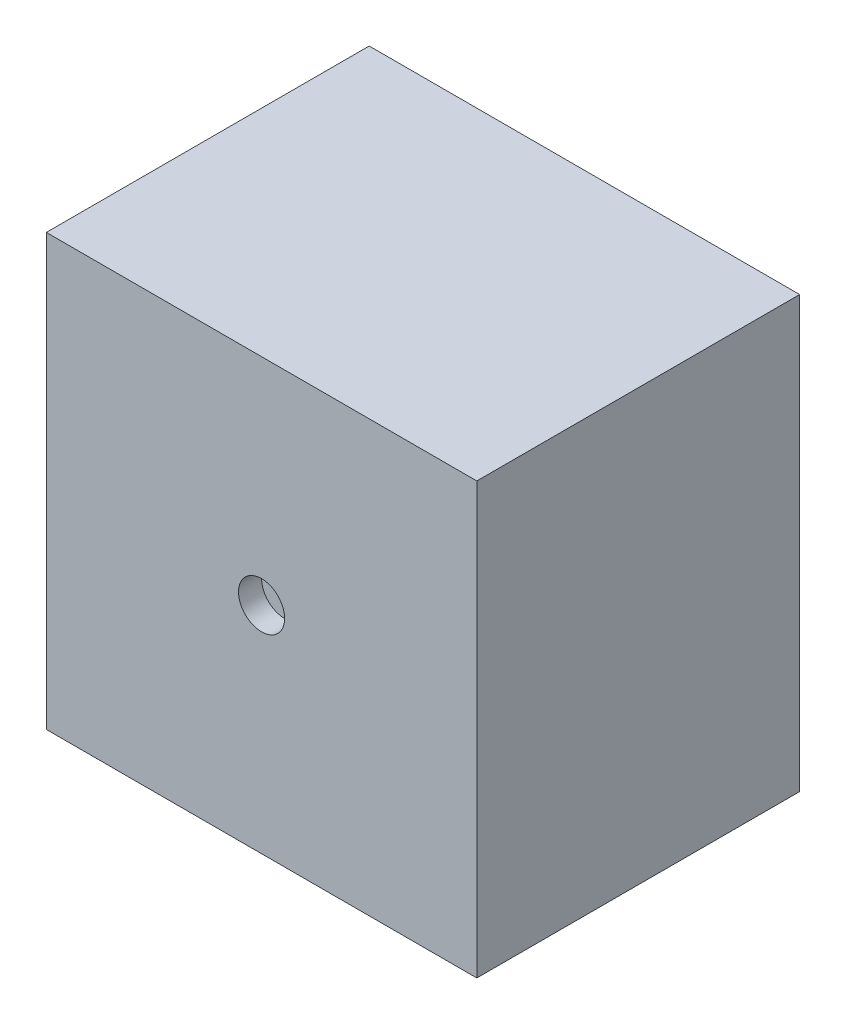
ISO-10303-21;
HEADER;
FILE_DESCRIPTION(('STEP AP214'),'2;1');
FILE_NAME('part.step','',(''),(''),'','','');
FILE_SCHEMA(('AUTOMOTIVE_DESIGN { 1 0 10303 214 1 1 1 1 }'));
ENDSEC;
DATA;
#1=APPLICATION_CONTEXT('core data for automotive mechanical design processes');
#2=APPLICATION_PROTOCOL_DEFINITION('international standard','automotive_design',2000,#1);
#3=PRODUCT_CONTEXT('',#1,'mechanical');
#4=PRODUCT('Part','Part','',(#3));
#5=PRODUCT_RELATED_PRODUCT_CATEGORY('part','',(#4));
#6=PRODUCT_DEFINITION_FORMATION('','',#4);
#7=PRODUCT_DEFINITION_CONTEXT('part definition',#1,'design');
#8=PRODUCT_DEFINITION('design','',#6,#7);
#9=PRODUCT_DEFINITION_SHAPE('','',#8);
#10=(LENGTH_UNIT() NAMED_UNIT(*) SI_UNIT(.MILLI.,.METRE.));
#11=(NAMED_UNIT(*) PLANE_ANGLE_UNIT() SI_UNIT($,.RADIAN.));
#12=(NAMED_UNIT(*) SI_UNIT($,.STERADIAN.) SOLID_ANGLE_UNIT());
#13=UNCERTAINTY_MEASURE_WITH_UNIT(LENGTH_MEASURE(1.E-05),#10,'distance_accuracy_value','');
#14=(GEOMETRIC_REPRESENTATION_CONTEXT(3) GLOBAL_UNCERTAINTY_ASSIGNED_CONTEXT((#13)) GLOBAL_UNIT_ASSIGNED_CONTEXT((#10,
#11,#12)) REPRESENTATION_CONTEXT('',''));
#15=CARTESIAN_POINT('',(0.,0.,0.));
#16=DIRECTION('',(0.,0.,1.));
#17=DIRECTION('',(1.,0.,0.));
#18=AXIS2_PLACEMENT_3D('',#15,#16,#17);
#19=CARTESIAN_POINT('',(0.,0.,42.));
#20=DIRECTION('',(-1.,0.,0.));
#21=DIRECTION('',(0.,-1.,0.));
#22=AXIS2_PLACEMENT_3D('',#19,#20,#21);
#23=PLANE('',#22);
#24=DIRECTION('',(0.,1.,0.));
#25=VECTOR('',#24,1.);
#26=CARTESIAN_POINT('',(0.,0.,0.));
#27=LINE('',#26,#25);
#28=CARTESIAN_POINT('',(0.,0.,0.));
#29=VERTEX_POINT('',#28);
#30=CARTESIAN_POINT('',(0.,56.,0.));
#31=VERTEX_POINT('',#30);
#32=EDGE_CURVE('E110',#29,#31,#27,.T.);
#33=ORIENTED_EDGE('',*,*,#32,.T.);
#34=DIRECTION('',(0.,0.,-1.));
#35=VECTOR('',#34,1.);
#36=CARTESIAN_POINT('',(0.,56.,42.));
#37=LINE('',#36,#35);
#38=CARTESIAN_POINT('',(0.,56.,42.));
#39=VERTEX_POINT('',#38);
#40=EDGE_CURVE('E11',#39,#31,#37,.T.);
#41=ORIENTED_EDGE('',*,*,#40,.F.);
#42=DIRECTION('',(0.,1.,0.));
#43=VECTOR('',#42,1.);
#44=CARTESIAN_POINT('',(0.,0.,42.));
#45=LINE('',#44,#43);
#46=CARTESIAN_POINT('',(0.,0.,42.));
#47=VERTEX_POINT('',#46);
#48=EDGE_CURVE('E94',#47,#39,#45,.T.);
#49=ORIENTED_EDGE('',*,*,#48,.F.);
#50=DIRECTION('',(0.,0.,-1.));
#51=VECTOR('',#50,1.);
#52=CARTESIAN_POINT('',(0.,0.,42.));
#53=LINE('',#52,#51);
#54=EDGE_CURVE('E106',#47,#29,#53,.T.);
#55=ORIENTED_EDGE('',*,*,#54,.T.);
#56=EDGE_LOOP('',(#33,#41,#49,#55));
#57=FACE_BOUND('',#56,.T.);
#58=ADVANCED_FACE('F42',(#57),#23,.F.);
#59=CARTESIAN_POINT('',(0.,56.,42.));
#60=DIRECTION('',(0.,-1.,0.));
#61=DIRECTION('',(1.,0.,0.));
#62=AXIS2_PLACEMENT_3D('',#59,#60,#61);
#63=PLANE('',#62);
#64=DIRECTION('',(-1.,0.,0.));
#65=VECTOR('',#64,1.);
#66=CARTESIAN_POINT('',(0.,56.,0.));
#67=LINE('',#66,#65);
#68=CARTESIAN_POINT('',(-56.,56.,0.));
#69=VERTEX_POINT('',#68);
#70=EDGE_CURVE('E99',#31,#69,#67,.T.);
#71=ORIENTED_EDGE('',*,*,#70,.T.);
#72=DIRECTION('',(0.,0.,-1.));
#73=VECTOR('',#72,1.);
#74=CARTESIAN_POINT('',(-56.,56.,42.));
#75=LINE('',#74,#73);
#76=CARTESIAN_POINT('',(-56.,56.,42.));
#77=VERTEX_POINT('',#76);
#78=EDGE_CURVE('E51',#77,#69,#75,.T.);
#79=ORIENTED_EDGE('',*,*,#78,.F.);
#80=DIRECTION('',(-1.,0.,0.));
#81=VECTOR('',#80,1.);
#82=CARTESIAN_POINT('',(0.,56.,42.));
#83=LINE('',#82,#81);
#84=EDGE_CURVE('E89',#39,#77,#83,.T.);
#85=ORIENTED_EDGE('',*,*,#84,.F.);
#86=ORIENTED_EDGE('',*,*,#40,.T.);
#87=EDGE_LOOP('',(#71,#79,#85,#86));
#88=FACE_BOUND('',#87,.T.);
#89=ADVANCED_FACE('F98',(#88),#63,.F.);
#90=CARTESIAN_POINT('',(-56.,0.,42.));
#91=DIRECTION('',(1.,0.,0.));
#92=DIRECTION('',(0.,0.,-1.));
#93=AXIS2_PLACEMENT_3D('',#90,#91,#92);
#94=PLANE('',#93);
#95=DIRECTION('',(0.,-1.,0.));
#96=VECTOR('',#95,1.);
#97=CARTESIAN_POINT('',(-56.,0.,0.));
#98=LINE('',#97,#96);
#99=CARTESIAN_POINT('',(-56.,0.,0.));
#100=VERTEX_POINT('',#99);
#101=EDGE_CURVE('E76',#69,#100,#98,.T.);
#102=ORIENTED_EDGE('',*,*,#101,.T.);
#103=DIRECTION('',(0.,0.,-1.));
#104=VECTOR('',#103,1.);
#105=CARTESIAN_POINT('',(-56.,0.,42.));
#106=LINE('',#105,#104);
#107=CARTESIAN_POINT('',(-56.,0.,42.));
#108=VERTEX_POINT('',#107);
#109=EDGE_CURVE('E101',#108,#100,#106,.T.);
#110=ORIENTED_EDGE('',*,*,#109,.F.);
#111=DIRECTION('',(0.,-1.,0.));
#112=VECTOR('',#111,1.);
#113=CARTESIAN_POINT('',(-56.,0.,42.));
#114=LINE('',#113,#112);
#115=EDGE_CURVE('E92',#77,#108,#114,.T.);
#116=ORIENTED_EDGE('',*,*,#115,.F.);
#117=ORIENTED_EDGE('',*,*,#78,.T.);
#118=EDGE_LOOP('',(#102,#110,#116,#117));
#119=FACE_BOUND('',#118,.T.);
#120=ADVANCED_FACE('F102',(#119),#94,.F.);
#121=CARTESIAN_POINT('',(0.,0.,42.));
#122=DIRECTION('',(0.,1.,0.));
#123=DIRECTION('',(0.,0.,1.));
#124=AXIS2_PLACEMENT_3D('',#121,#122,#123);
#125=PLANE('',#124);
#126=DIRECTION('',(1.,0.,0.));
#127=VECTOR('',#126,1.);
#128=CARTESIAN_POINT('',(0.,0.,0.));
#129=LINE('',#128,#127);
#130=EDGE_CURVE('E82',#100,#29,#129,.T.);
#131=ORIENTED_EDGE('',*,*,#130,.T.);
#132=ORIENTED_EDGE('',*,*,#54,.F.);
#133=DIRECTION('',(1.,0.,0.));
#134=VECTOR('',#133,1.);
#135=CARTESIAN_POINT('',(0.,0.,42.));
#136=LINE('',#135,#134);
#137=EDGE_CURVE('E59',#108,#47,#136,.T.);
#138=ORIENTED_EDGE('',*,*,#137,.F.);
#139=ORIENTED_EDGE('',*,*,#109,.T.);
#140=EDGE_LOOP('',(#131,#132,#138,#139));
#141=FACE_BOUND('',#140,.T.);
#142=ADVANCED_FACE('F124',(#141),#125,.F.);
#143=CARTESIAN_POINT('',(0.,0.,42.));
#144=DIRECTION('',(0.,0.,1.));
#145=DIRECTION('',(1.,0.,0.));
#146=AXIS2_PLACEMENT_3D('',#143,#144,#145);
#147=PLANE('',#146);
#148=CARTESIAN_POINT('',(-28.,28.,42.));
#149=DIRECTION('',(0.,0.,1.));
#150=DIRECTION('',(1.,0.,0.));
#151=AXIS2_PLACEMENT_3D('',#148,#149,#150);
#152=CIRCLE('',#151,3.00000000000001);
#153=CARTESIAN_POINT('',(-25.,28.,42.));
#154=VERTEX_POINT('',#153);
#155=EDGE_CURVE('E131',#154,#154,#152,.T.);
#156=ORIENTED_EDGE('',*,*,#155,.F.);
#157=EDGE_LOOP('',(#156));
#158=FACE_BOUND('',#157,.T.);
#159=ORIENTED_EDGE('',*,*,#48,.T.);
#160=ORIENTED_EDGE('',*,*,#84,.T.);
#161=ORIENTED_EDGE('',*,*,#115,.T.);
#162=ORIENTED_EDGE('',*,*,#137,.T.);
#163=EDGE_LOOP('',(#159,#160,#161,#162));
#164=FACE_BOUND('',#163,.T.);
#165=ADVANCED_FACE('F90',(#158,#164),#147,.T.);
#166=CARTESIAN_POINT('',(0.,0.,0.));
#167=DIRECTION('',(0.,0.,1.));
#168=DIRECTION('',(1.,0.,0.));
#169=AXIS2_PLACEMENT_3D('',#166,#167,#168);
#170=PLANE('',#169);
#171=ORIENTED_EDGE('',*,*,#32,.F.);
#172=ORIENTED_EDGE('',*,*,#130,.F.);
#173=ORIENTED_EDGE('',*,*,#101,.F.);
#174=ORIENTED_EDGE('',*,*,#70,.F.);
#175=EDGE_LOOP('',(#171,#172,#173,#174));
#176=FACE_BOUND('',#175,.T.);
#177=ADVANCED_FACE('F127',(#176),#170,.F.);
#178=CARTESIAN_POINT('',(-28.,28.,39.));
#179=DIRECTION('',(0.,0.,1.));
#180=DIRECTION('',(1.,0.,0.));
#181=AXIS2_PLACEMENT_3D('',#178,#179,#180);
#182=CYLINDRICAL_SURFACE('',#181,3.00000000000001);
#183=CARTESIAN_POINT('',(-28.,28.,39.));
#184=DIRECTION('',(0.,0.,1.));
#185=DIRECTION('',(1.,0.,0.));
#186=AXIS2_PLACEMENT_3D('',#183,#184,#185);
#187=CIRCLE('',#186,3.00000000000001);
#188=CARTESIAN_POINT('',(-25.,28.,39.));
#189=VERTEX_POINT('',#188);
#190=EDGE_CURVE('E114',#189,#189,#187,.T.);
#191=ORIENTED_EDGE('',*,*,#190,.F.);
#192=EDGE_LOOP('',(#191));
#193=FACE_BOUND('',#192,.T.);
#194=ORIENTED_EDGE('',*,*,#155,.T.);
#195=EDGE_LOOP('',(#194));
#196=FACE_BOUND('',#195,.T.);
#197=ADVANCED_FACE('F141',(#193,#196),#182,.F.);
#198=CARTESIAN_POINT('',(-28.,28.,39.));
#199=DIRECTION('',(0.,0.,1.));
#200=DIRECTION('',(1.,0.,0.));
#201=AXIS2_PLACEMENT_3D('',#198,#199,#200);
#202=PLANE('',#201);
#203=ORIENTED_EDGE('',*,*,#190,.T.);
#204=EDGE_LOOP('',(#203));
#205=FACE_BOUND('',#204,.T.);
#206=ADVANCED_FACE('F139',(#205),#202,.T.);
#207=CLOSED_SHELL('',(#58,#89,#120,#142,#165,#177,#197,#206));
#208=MANIFOLD_SOLID_BREP('B2',#207);
#209=ADVANCED_BREP_SHAPE_REPRESENTATION('',(#18,#208),#14);
#210=SHAPE_DEFINITION_REPRESENTATION(#9,#209);
ENDSEC;
END-ISO-10303-21;
